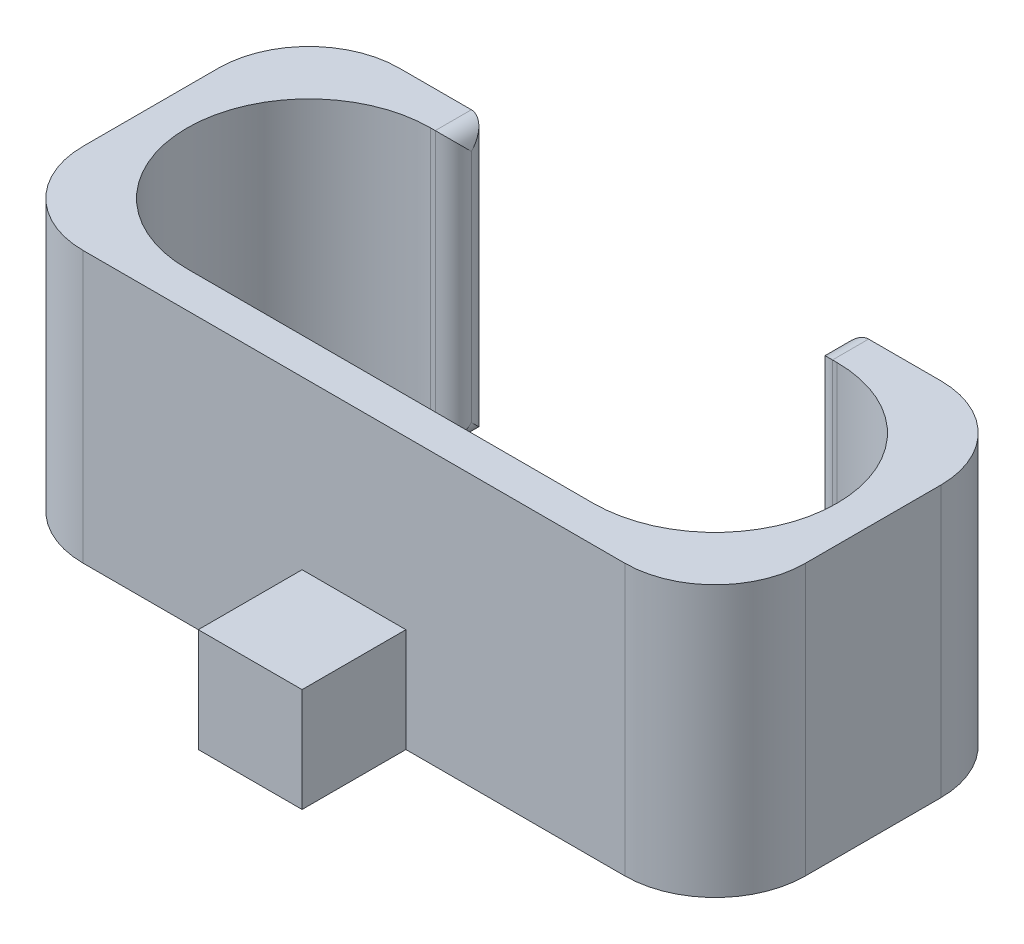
ISO-10303-21;
HEADER;
FILE_DESCRIPTION(('STEP AP214'),'2;1');
FILE_NAME('part.step','',(''),(''),'','','');
FILE_SCHEMA(('AUTOMOTIVE_DESIGN { 1 0 10303 214 1 1 1 1 }'));
ENDSEC;
DATA;
#1=APPLICATION_CONTEXT('core data for automotive mechanical design processes');
#2=APPLICATION_PROTOCOL_DEFINITION('international standard','automotive_design',2000,#1);
#3=PRODUCT_CONTEXT('',#1,'mechanical');
#4=PRODUCT('Part','Part','',(#3));
#5=PRODUCT_RELATED_PRODUCT_CATEGORY('part','',(#4));
#6=PRODUCT_DEFINITION_FORMATION('','',#4);
#7=PRODUCT_DEFINITION_CONTEXT('part definition',#1,'design');
#8=PRODUCT_DEFINITION('design','',#6,#7);
#9=PRODUCT_DEFINITION_SHAPE('','',#8);
#10=(LENGTH_UNIT() NAMED_UNIT(*) SI_UNIT(.MILLI.,.METRE.));
#11=(NAMED_UNIT(*) PLANE_ANGLE_UNIT() SI_UNIT($,.RADIAN.));
#12=(NAMED_UNIT(*) SI_UNIT($,.STERADIAN.) SOLID_ANGLE_UNIT());
#13=UNCERTAINTY_MEASURE_WITH_UNIT(LENGTH_MEASURE(1.E-05),#10,'distance_accuracy_value','');
#14=(GEOMETRIC_REPRESENTATION_CONTEXT(3) GLOBAL_UNCERTAINTY_ASSIGNED_CONTEXT((#13)) GLOBAL_UNIT_ASSIGNED_CONTEXT((#10,
#11,#12)) REPRESENTATION_CONTEXT('',''));
#15=CARTESIAN_POINT('',(0.,0.,0.));
#16=DIRECTION('',(0.,0.,1.));
#17=DIRECTION('',(1.,0.,0.));
#18=AXIS2_PLACEMENT_3D('',#15,#16,#17);
#19=CARTESIAN_POINT('',(-40.,30.,-35.));
#20=DIRECTION('',(0.,0.,1.));
#21=DIRECTION('',(1.,0.,0.));
#22=AXIS2_PLACEMENT_3D('',#19,#20,#21);
#23=PLANE('',#22);
#24=DIRECTION('',(-1.,0.,0.));
#25=VECTOR('',#24,1.);
#26=CARTESIAN_POINT('',(-40.,0.,-35.));
#27=LINE('',#26,#25);
#28=CARTESIAN_POINT('',(30.,0.,-35.));
#29=VERTEX_POINT('',#28);
#30=CARTESIAN_POINT('',(22.,0.,-35.));
#31=VERTEX_POINT('',#30);
#32=EDGE_CURVE('E202',#29,#31,#27,.T.);
#33=ORIENTED_EDGE('',*,*,#32,.T.);
#34=DIRECTION('',(0.,1.,0.));
#35=VECTOR('',#34,1.);
#36=CARTESIAN_POINT('',(22.,30.,-35.));
#37=LINE('',#36,#35);
#38=CARTESIAN_POINT('',(22.,30.,-35.));
#39=VERTEX_POINT('',#38);
#40=EDGE_CURVE('E12',#31,#39,#37,.T.);
#41=ORIENTED_EDGE('',*,*,#40,.T.);
#42=DIRECTION('',(-1.,0.,0.));
#43=VECTOR('',#42,1.);
#44=CARTESIAN_POINT('',(-40.,30.,-35.));
#45=LINE('',#44,#43);
#46=CARTESIAN_POINT('',(30.,30.,-35.));
#47=VERTEX_POINT('',#46);
#48=EDGE_CURVE('E265',#47,#39,#45,.T.);
#49=ORIENTED_EDGE('',*,*,#48,.F.);
#50=DIRECTION('',(0.,-1.,0.));
#51=VECTOR('',#50,1.);
#52=CARTESIAN_POINT('',(30.,30.,-35.));
#53=LINE('',#52,#51);
#54=EDGE_CURVE('E135',#47,#29,#53,.T.);
#55=ORIENTED_EDGE('',*,*,#54,.T.);
#56=EDGE_LOOP('',(#33,#41,#49,#55));
#57=FACE_BOUND('',#56,.T.);
#58=ADVANCED_FACE('F42',(#57),#23,.F.);
#59=CARTESIAN_POINT('',(-22.5,0.,-31.));
#60=DIRECTION('',(0.,0.,-1.));
#61=DIRECTION('',(-1.,0.,0.));
#62=AXIS2_PLACEMENT_3D('',#59,#60,#61);
#63=PLANE('',#62);
#64=DIRECTION('',(-1.,0.,0.));
#65=VECTOR('',#64,1.);
#66=CARTESIAN_POINT('',(-22.5,30.,-31.));
#67=LINE('',#66,#65);
#68=CARTESIAN_POINT('',(22.5,30.,-31.));
#69=VERTEX_POINT('',#68);
#70=CARTESIAN_POINT('',(22.,30.,-31.));
#71=VERTEX_POINT('',#70);
#72=EDGE_CURVE('E245',#69,#71,#67,.T.);
#73=ORIENTED_EDGE('',*,*,#72,.T.);
#74=DIRECTION('',(0.,1.,0.));
#75=VECTOR('',#74,1.);
#76=CARTESIAN_POINT('',(22.,0.,-31.));
#77=LINE('',#76,#75);
#78=CARTESIAN_POINT('',(22.,0.,-31.));
#79=VERTEX_POINT('',#78);
#80=EDGE_CURVE('E52',#71,#79,#77,.F.);
#81=ORIENTED_EDGE('',*,*,#80,.T.);
#82=DIRECTION('',(-1.,0.,0.));
#83=VECTOR('',#82,1.);
#84=CARTESIAN_POINT('',(-22.5,0.,-31.));
#85=LINE('',#84,#83);
#86=CARTESIAN_POINT('',(22.5,0.,-31.));
#87=VERTEX_POINT('',#86);
#88=EDGE_CURVE('E240',#87,#79,#85,.T.);
#89=ORIENTED_EDGE('',*,*,#88,.F.);
#90=DIRECTION('',(0.,1.,0.));
#91=VECTOR('',#90,1.);
#92=CARTESIAN_POINT('',(22.5,0.,-31.));
#93=LINE('',#92,#91);
#94=EDGE_CURVE('E252',#87,#69,#93,.T.);
#95=ORIENTED_EDGE('',*,*,#94,.T.);
#96=EDGE_LOOP('',(#73,#81,#89,#95));
#97=FACE_BOUND('',#96,.T.);
#98=ADVANCED_FACE('F404',(#97),#63,.F.);
#99=CARTESIAN_POINT('',(-40.,30.,0.));
#100=DIRECTION('',(0.,0.,-1.));
#101=DIRECTION('',(-1.,0.,0.));
#102=AXIS2_PLACEMENT_3D('',#99,#100,#101);
#103=PLANE('',#102);
#104=DIRECTION('',(1.,0.,0.));
#105=VECTOR('',#104,1.);
#106=CARTESIAN_POINT('',(-40.,30.,0.));
#107=LINE('',#106,#105);
#108=CARTESIAN_POINT('',(-30.,30.,0.));
#109=VERTEX_POINT('',#108);
#110=CARTESIAN_POINT('',(30.,30.,0.));
#111=VERTEX_POINT('',#110);
#112=EDGE_CURVE('E259',#109,#111,#107,.T.);
#113=ORIENTED_EDGE('',*,*,#112,.F.);
#114=DIRECTION('',(0.,-1.,0.));
#115=VECTOR('',#114,1.);
#116=CARTESIAN_POINT('',(-30.,30.,0.));
#117=LINE('',#116,#115);
#118=CARTESIAN_POINT('',(-30.,0.,0.));
#119=VERTEX_POINT('',#118);
#120=EDGE_CURVE('E177',#109,#119,#117,.T.);
#121=ORIENTED_EDGE('',*,*,#120,.T.);
#122=DIRECTION('',(1.,0.,0.));
#123=VECTOR('',#122,1.);
#124=CARTESIAN_POINT('',(-40.,0.,0.));
#125=LINE('',#124,#123);
#126=CARTESIAN_POINT('',(-5.75,0.,0.));
#127=VERTEX_POINT('',#126);
#128=EDGE_CURVE('E184',#119,#127,#125,.T.);
#129=ORIENTED_EDGE('',*,*,#128,.T.);
#130=DIRECTION('',(0.,-1.,0.));
#131=VECTOR('',#130,1.);
#132=CARTESIAN_POINT('',(-5.75,11.5,0.));
#133=LINE('',#132,#131);
#134=CARTESIAN_POINT('',(-5.75,11.5,0.));
#135=VERTEX_POINT('',#134);
#136=EDGE_CURVE('E207',#135,#127,#133,.T.);
#137=ORIENTED_EDGE('',*,*,#136,.F.);
#138=DIRECTION('',(-1.,0.,0.));
#139=VECTOR('',#138,1.);
#140=CARTESIAN_POINT('',(5.75,11.5,0.));
#141=LINE('',#140,#139);
#142=CARTESIAN_POINT('',(5.75,11.5,0.));
#143=VERTEX_POINT('',#142);
#144=EDGE_CURVE('E206',#143,#135,#141,.T.);
#145=ORIENTED_EDGE('',*,*,#144,.F.);
#146=DIRECTION('',(0.,1.,0.));
#147=VECTOR('',#146,1.);
#148=CARTESIAN_POINT('',(5.75,0.,0.));
#149=LINE('',#148,#147);
#150=CARTESIAN_POINT('',(5.75,0.,0.));
#151=VERTEX_POINT('',#150);
#152=EDGE_CURVE('E203',#151,#143,#149,.T.);
#153=ORIENTED_EDGE('',*,*,#152,.F.);
#154=CARTESIAN_POINT('',(30.,0.,0.));
#155=VERTEX_POINT('',#154);
#156=EDGE_CURVE('E189',#151,#155,#125,.T.);
#157=ORIENTED_EDGE('',*,*,#156,.T.);
#158=DIRECTION('',(0.,-1.,0.));
#159=VECTOR('',#158,1.);
#160=CARTESIAN_POINT('',(30.,30.,0.));
#161=LINE('',#160,#159);
#162=EDGE_CURVE('E180',#155,#111,#161,.F.);
#163=ORIENTED_EDGE('',*,*,#162,.T.);
#164=EDGE_LOOP('',(#113,#121,#129,#137,#145,#153,#157,#163));
#165=FACE_BOUND('',#164,.T.);
#166=ADVANCED_FACE('F323',(#165),#103,.F.);
#167=CARTESIAN_POINT('',(-40.,30.,0.));
#168=DIRECTION('',(1.,0.,0.));
#169=DIRECTION('',(0.,0.,-1.));
#170=AXIS2_PLACEMENT_3D('',#167,#168,#169);
#171=PLANE('',#170);
#172=DIRECTION('',(0.,0.,1.));
#173=VECTOR('',#172,1.);
#174=CARTESIAN_POINT('',(-40.,0.,0.));
#175=LINE('',#174,#173);
#176=CARTESIAN_POINT('',(-40.,0.,-25.));
#177=VERTEX_POINT('',#176);
#178=CARTESIAN_POINT('',(-40.,0.,-10.));
#179=VERTEX_POINT('',#178);
#180=EDGE_CURVE('E195',#177,#179,#175,.T.);
#181=ORIENTED_EDGE('',*,*,#180,.T.);
#182=DIRECTION('',(0.,-1.,0.));
#183=VECTOR('',#182,1.);
#184=CARTESIAN_POINT('',(-40.,30.,-10.));
#185=LINE('',#184,#183);
#186=CARTESIAN_POINT('',(-40.,30.,-10.));
#187=VERTEX_POINT('',#186);
#188=EDGE_CURVE('E159',#179,#187,#185,.F.);
#189=ORIENTED_EDGE('',*,*,#188,.T.);
#190=DIRECTION('',(0.,0.,1.));
#191=VECTOR('',#190,1.);
#192=CARTESIAN_POINT('',(-40.,30.,0.));
#193=LINE('',#192,#191);
#194=CARTESIAN_POINT('',(-40.,30.,-25.));
#195=VERTEX_POINT('',#194);
#196=EDGE_CURVE('E256',#195,#187,#193,.T.);
#197=ORIENTED_EDGE('',*,*,#196,.F.);
#198=DIRECTION('',(0.,-1.,0.));
#199=VECTOR('',#198,1.);
#200=CARTESIAN_POINT('',(-40.,30.,-25.));
#201=LINE('',#200,#199);
#202=EDGE_CURVE('E162',#195,#177,#201,.T.);
#203=ORIENTED_EDGE('',*,*,#202,.T.);
#204=EDGE_LOOP('',(#181,#189,#197,#203));
#205=FACE_BOUND('',#204,.T.);
#206=ADVANCED_FACE('F302',(#205),#171,.F.);
#207=CARTESIAN_POINT('',(40.,30.,0.));
#208=DIRECTION('',(-1.,0.,0.));
#209=DIRECTION('',(0.,0.,1.));
#210=AXIS2_PLACEMENT_3D('',#207,#208,#209);
#211=PLANE('',#210);
#212=DIRECTION('',(0.,0.,-1.));
#213=VECTOR('',#212,1.);
#214=CARTESIAN_POINT('',(40.,30.,0.));
#215=LINE('',#214,#213);
#216=CARTESIAN_POINT('',(40.,30.,-10.));
#217=VERTEX_POINT('',#216);
#218=CARTESIAN_POINT('',(40.,30.,-25.));
#219=VERTEX_POINT('',#218);
#220=EDGE_CURVE('E262',#217,#219,#215,.T.);
#221=ORIENTED_EDGE('',*,*,#220,.F.);
#222=DIRECTION('',(0.,-1.,0.));
#223=VECTOR('',#222,1.);
#224=CARTESIAN_POINT('',(40.,30.,-10.));
#225=LINE('',#224,#223);
#226=CARTESIAN_POINT('',(40.,0.,-10.));
#227=VERTEX_POINT('',#226);
#228=EDGE_CURVE('E138',#217,#227,#225,.T.);
#229=ORIENTED_EDGE('',*,*,#228,.T.);
#230=DIRECTION('',(0.,0.,-1.));
#231=VECTOR('',#230,1.);
#232=CARTESIAN_POINT('',(40.,0.,0.));
#233=LINE('',#232,#231);
#234=CARTESIAN_POINT('',(40.,0.,-25.));
#235=VERTEX_POINT('',#234);
#236=EDGE_CURVE('E188',#227,#235,#233,.T.);
#237=ORIENTED_EDGE('',*,*,#236,.T.);
#238=DIRECTION('',(0.,-1.,0.));
#239=VECTOR('',#238,1.);
#240=CARTESIAN_POINT('',(40.,30.,-25.));
#241=LINE('',#240,#239);
#242=EDGE_CURVE('E141',#235,#219,#241,.F.);
#243=ORIENTED_EDGE('',*,*,#242,.T.);
#244=EDGE_LOOP('',(#221,#229,#237,#243));
#245=FACE_BOUND('',#244,.T.);
#246=ADVANCED_FACE('F342',(#245),#211,.F.);
#247=CARTESIAN_POINT('',(-22.,30.,-35.));
#248=VERTEX_POINT('',#247);
#249=CARTESIAN_POINT('',(-30.,30.,-35.));
#250=VERTEX_POINT('',#249);
#251=EDGE_CURVE('E264',#248,#250,#45,.T.);
#252=ORIENTED_EDGE('',*,*,#251,.F.);
#253=DIRECTION('',(0.,1.,0.));
#254=VECTOR('',#253,1.);
#255=CARTESIAN_POINT('',(-22.,30.,-35.));
#256=LINE('',#255,#254);
#257=CARTESIAN_POINT('',(-22.,0.,-35.));
#258=VERTEX_POINT('',#257);
#259=EDGE_CURVE('E132',#248,#258,#256,.F.);
#260=ORIENTED_EDGE('',*,*,#259,.T.);
#261=CARTESIAN_POINT('',(-30.,0.,-35.));
#262=VERTEX_POINT('',#261);
#263=EDGE_CURVE('E291',#258,#262,#27,.T.);
#264=ORIENTED_EDGE('',*,*,#263,.T.);
#265=DIRECTION('',(0.,-1.,0.));
#266=VECTOR('',#265,1.);
#267=CARTESIAN_POINT('',(-30.,30.,-35.));
#268=LINE('',#267,#266);
#269=EDGE_CURVE('E144',#262,#250,#268,.F.);
#270=ORIENTED_EDGE('',*,*,#269,.T.);
#271=EDGE_LOOP('',(#252,#260,#264,#270));
#272=FACE_BOUND('',#271,.T.);
#273=ADVANCED_FACE('F288',(#272),#23,.F.);
#274=CARTESIAN_POINT('',(0.,30.,0.));
#275=DIRECTION('',(0.,-1.,0.));
#276=DIRECTION('',(0.,0.,-1.));
#277=AXIS2_PLACEMENT_3D('',#274,#275,#276);
#278=PLANE('',#277);
#279=CARTESIAN_POINT('',(-22.,30.,-31.));
#280=VERTEX_POINT('',#279);
#281=CARTESIAN_POINT('',(-22.5,30.,-31.));
#282=VERTEX_POINT('',#281);
#283=EDGE_CURVE('E248',#280,#282,#67,.T.);
#284=ORIENTED_EDGE('',*,*,#283,.F.);
#285=DIRECTION('',(0.,0.,1.));
#286=VECTOR('',#285,1.);
#287=CARTESIAN_POINT('',(-22.,30.,0.));
#288=LINE('',#287,#286);
#289=EDGE_CURVE('E121',#280,#248,#288,.F.);
#290=ORIENTED_EDGE('',*,*,#289,.T.);
#291=ORIENTED_EDGE('',*,*,#251,.T.);
#292=CARTESIAN_POINT('',(-30.,30.,-25.));
#293=DIRECTION('',(0.,-1.,0.));
#294=DIRECTION('',(0.,0.,-1.));
#295=AXIS2_PLACEMENT_3D('',#292,#293,#294);
#296=CIRCLE('',#295,10.);
#297=EDGE_CURVE('E150',#250,#195,#296,.F.);
#298=ORIENTED_EDGE('',*,*,#297,.T.);
#299=ORIENTED_EDGE('',*,*,#196,.T.);
#300=CARTESIAN_POINT('',(-30.,30.,-10.));
#301=DIRECTION('',(0.,-1.,0.));
#302=DIRECTION('',(0.,0.,-1.));
#303=AXIS2_PLACEMENT_3D('',#300,#301,#302);
#304=CIRCLE('',#303,10.);
#305=EDGE_CURVE('E147',#187,#109,#304,.F.);
#306=ORIENTED_EDGE('',*,*,#305,.T.);
#307=ORIENTED_EDGE('',*,*,#112,.T.);
#308=CARTESIAN_POINT('',(30.,30.,-10.));
#309=DIRECTION('',(0.,-1.,0.));
#310=DIRECTION('',(0.,0.,-1.));
#311=AXIS2_PLACEMENT_3D('',#308,#309,#310);
#312=CIRCLE('',#311,10.);
#313=EDGE_CURVE('E153',#111,#217,#312,.F.);
#314=ORIENTED_EDGE('',*,*,#313,.T.);
#315=ORIENTED_EDGE('',*,*,#220,.T.);
#316=CARTESIAN_POINT('',(30.,30.,-25.));
#317=DIRECTION('',(0.,-1.,0.));
#318=DIRECTION('',(0.,0.,-1.));
#319=AXIS2_PLACEMENT_3D('',#316,#317,#318);
#320=CIRCLE('',#319,10.);
#321=EDGE_CURVE('E156',#219,#47,#320,.F.);
#322=ORIENTED_EDGE('',*,*,#321,.T.);
#323=ORIENTED_EDGE('',*,*,#48,.T.);
#324=DIRECTION('',(0.,0.,-1.));
#325=VECTOR('',#324,1.);
#326=CARTESIAN_POINT('',(22.,30.,0.));
#327=LINE('',#326,#325);
#328=EDGE_CURVE('E61',#39,#71,#327,.F.);
#329=ORIENTED_EDGE('',*,*,#328,.T.);
#330=ORIENTED_EDGE('',*,*,#72,.F.);
#331=CARTESIAN_POINT('',(22.5,30.,-17.5));
#332=DIRECTION('',(0.,1.,0.));
#333=DIRECTION('',(0.,0.,1.));
#334=AXIS2_PLACEMENT_3D('',#331,#332,#333);
#335=CIRCLE('',#334,13.5);
#336=CARTESIAN_POINT('',(22.5,30.,-4.00000000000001));
#337=VERTEX_POINT('',#336);
#338=EDGE_CURVE('E751',#337,#69,#335,.T.);
#339=ORIENTED_EDGE('',*,*,#338,.F.);
#340=DIRECTION('',(1.,0.,0.));
#341=VECTOR('',#340,1.);
#342=CARTESIAN_POINT('',(0.,30.,-4.));
#343=LINE('',#342,#341);
#344=CARTESIAN_POINT('',(-22.5,30.,-4.));
#345=VERTEX_POINT('',#344);
#346=EDGE_CURVE('E219',#345,#337,#343,.T.);
#347=ORIENTED_EDGE('',*,*,#346,.F.);
#348=CARTESIAN_POINT('',(-22.5,30.,-17.5));
#349=DIRECTION('',(0.,1.,0.));
#350=DIRECTION('',(0.,0.,1.));
#351=AXIS2_PLACEMENT_3D('',#348,#349,#350);
#352=CIRCLE('',#351,13.5);
#353=EDGE_CURVE('E225',#282,#345,#352,.T.);
#354=ORIENTED_EDGE('',*,*,#353,.F.);
#355=EDGE_LOOP('',(#284,#290,#291,#298,#299,#306,#307,#314,#315,#322,#323,#329,#330,#339,#347,#354));
#356=FACE_BOUND('',#355,.T.);
#357=ADVANCED_FACE('F275',(#356),#278,.F.);
#358=CARTESIAN_POINT('',(0.,0.,0.));
#359=DIRECTION('',(0.,-1.,0.));
#360=DIRECTION('',(0.,0.,-1.));
#361=AXIS2_PLACEMENT_3D('',#358,#359,#360);
#362=PLANE('',#361);
#363=ORIENTED_EDGE('',*,*,#263,.F.);
#364=DIRECTION('',(0.,0.,1.));
#365=VECTOR('',#364,1.);
#366=CARTESIAN_POINT('',(-22.,0.,-31.));
#367=LINE('',#366,#365);
#368=CARTESIAN_POINT('',(-22.,0.,-31.));
#369=VERTEX_POINT('',#368);
#370=EDGE_CURVE('E128',#258,#369,#367,.T.);
#371=ORIENTED_EDGE('',*,*,#370,.T.);
#372=CARTESIAN_POINT('',(-22.5,0.,-31.));
#373=VERTEX_POINT('',#372);
#374=EDGE_CURVE('E244',#369,#373,#85,.T.);
#375=ORIENTED_EDGE('',*,*,#374,.T.);
#376=CARTESIAN_POINT('',(-22.5,0.,-17.5));
#377=DIRECTION('',(0.,1.,0.));
#378=DIRECTION('',(0.,0.,1.));
#379=AXIS2_PLACEMENT_3D('',#376,#377,#378);
#380=CIRCLE('',#379,13.5);
#381=CARTESIAN_POINT('',(-22.5,0.,-4.));
#382=VERTEX_POINT('',#381);
#383=EDGE_CURVE('E755',#373,#382,#380,.T.);
#384=ORIENTED_EDGE('',*,*,#383,.T.);
#385=DIRECTION('',(1.,0.,0.));
#386=VECTOR('',#385,1.);
#387=CARTESIAN_POINT('',(0.,0.,-4.));
#388=LINE('',#387,#386);
#389=CARTESIAN_POINT('',(22.5,0.,-4.00000000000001));
#390=VERTEX_POINT('',#389);
#391=EDGE_CURVE('E247',#382,#390,#388,.T.);
#392=ORIENTED_EDGE('',*,*,#391,.T.);
#393=CARTESIAN_POINT('',(22.5,0.,-17.5));
#394=DIRECTION('',(0.,1.,0.));
#395=DIRECTION('',(0.,0.,1.));
#396=AXIS2_PLACEMENT_3D('',#393,#394,#395);
#397=CIRCLE('',#396,13.5);
#398=EDGE_CURVE('E749',#390,#87,#397,.T.);
#399=ORIENTED_EDGE('',*,*,#398,.T.);
#400=ORIENTED_EDGE('',*,*,#88,.T.);
#401=DIRECTION('',(0.,0.,-1.));
#402=VECTOR('',#401,1.);
#403=CARTESIAN_POINT('',(22.,0.,-35.));
#404=LINE('',#403,#402);
#405=EDGE_CURVE('E97',#79,#31,#404,.T.);
#406=ORIENTED_EDGE('',*,*,#405,.T.);
#407=ORIENTED_EDGE('',*,*,#32,.F.);
#408=CARTESIAN_POINT('',(30.,0.,-25.));
#409=DIRECTION('',(0.,-1.,0.));
#410=DIRECTION('',(0.,0.,-1.));
#411=AXIS2_PLACEMENT_3D('',#408,#409,#410);
#412=CIRCLE('',#411,10.);
#413=EDGE_CURVE('E174',#29,#235,#412,.T.);
#414=ORIENTED_EDGE('',*,*,#413,.T.);
#415=ORIENTED_EDGE('',*,*,#236,.F.);
#416=CARTESIAN_POINT('',(30.,0.,-10.));
#417=DIRECTION('',(0.,-1.,0.));
#418=DIRECTION('',(0.,0.,-1.));
#419=AXIS2_PLACEMENT_3D('',#416,#417,#418);
#420=CIRCLE('',#419,10.);
#421=EDGE_CURVE('E171',#227,#155,#420,.T.);
#422=ORIENTED_EDGE('',*,*,#421,.T.);
#423=ORIENTED_EDGE('',*,*,#156,.F.);
#424=DIRECTION('',(0.,0.,-1.));
#425=VECTOR('',#424,1.);
#426=CARTESIAN_POINT('',(5.75,0.,11.5));
#427=LINE('',#426,#425);
#428=CARTESIAN_POINT('',(5.75,0.,11.5));
#429=VERTEX_POINT('',#428);
#430=EDGE_CURVE('E210',#429,#151,#427,.T.);
#431=ORIENTED_EDGE('',*,*,#430,.F.);
#432=DIRECTION('',(1.,0.,0.));
#433=VECTOR('',#432,1.);
#434=CARTESIAN_POINT('',(-5.75,0.,11.5));
#435=LINE('',#434,#433);
#436=CARTESIAN_POINT('',(-5.75,0.,11.5));
#437=VERTEX_POINT('',#436);
#438=EDGE_CURVE('E770',#437,#429,#435,.T.);
#439=ORIENTED_EDGE('',*,*,#438,.F.);
#440=DIRECTION('',(0.,0.,-1.));
#441=VECTOR('',#440,1.);
#442=CARTESIAN_POINT('',(-5.75,0.,11.5));
#443=LINE('',#442,#441);
#444=EDGE_CURVE('E213',#437,#127,#443,.T.);
#445=ORIENTED_EDGE('',*,*,#444,.T.);
#446=ORIENTED_EDGE('',*,*,#128,.F.);
#447=CARTESIAN_POINT('',(-30.,0.,-10.));
#448=DIRECTION('',(0.,-1.,0.));
#449=DIRECTION('',(0.,0.,-1.));
#450=AXIS2_PLACEMENT_3D('',#447,#448,#449);
#451=CIRCLE('',#450,10.);
#452=EDGE_CURVE('E165',#119,#179,#451,.T.);
#453=ORIENTED_EDGE('',*,*,#452,.T.);
#454=ORIENTED_EDGE('',*,*,#180,.F.);
#455=CARTESIAN_POINT('',(-30.,0.,-25.));
#456=DIRECTION('',(0.,-1.,0.));
#457=DIRECTION('',(0.,0.,-1.));
#458=AXIS2_PLACEMENT_3D('',#455,#456,#457);
#459=CIRCLE('',#458,10.);
#460=EDGE_CURVE('E168',#177,#262,#459,.T.);
#461=ORIENTED_EDGE('',*,*,#460,.T.);
#462=EDGE_LOOP('',(#363,#371,#375,#384,#392,#399,#400,#406,#407,#414,#415,#422,#423,#431,#439,
#445,#446,#453,#454,#461));
#463=FACE_BOUND('',#462,.T.);
#464=ADVANCED_FACE('F308',(#463),#362,.T.);
#465=ORIENTED_EDGE('',*,*,#374,.F.);
#466=DIRECTION('',(0.,1.,0.));
#467=VECTOR('',#466,1.);
#468=CARTESIAN_POINT('',(-22.,0.,-31.));
#469=LINE('',#468,#467);
#470=EDGE_CURVE('E125',#369,#280,#469,.T.);
#471=ORIENTED_EDGE('',*,*,#470,.T.);
#472=ORIENTED_EDGE('',*,*,#283,.T.);
#473=DIRECTION('',(0.,1.,0.));
#474=VECTOR('',#473,1.);
#475=CARTESIAN_POINT('',(-22.5,0.,-31.));
#476=LINE('',#475,#474);
#477=EDGE_CURVE('E249',#373,#282,#476,.T.);
#478=ORIENTED_EDGE('',*,*,#477,.F.);
#479=EDGE_LOOP('',(#465,#471,#472,#478));
#480=FACE_BOUND('',#479,.T.);
#481=ADVANCED_FACE('F369',(#480),#63,.F.);
#482=CARTESIAN_POINT('',(-5.75,11.5,11.5));
#483=DIRECTION('',(1.,0.,0.));
#484=DIRECTION('',(0.,1.,0.));
#485=AXIS2_PLACEMENT_3D('',#482,#483,#484);
#486=PLANE('',#485);
#487=ORIENTED_EDGE('',*,*,#136,.T.);
#488=ORIENTED_EDGE('',*,*,#444,.F.);
#489=DIRECTION('',(0.,-1.,0.));
#490=VECTOR('',#489,1.);
#491=CARTESIAN_POINT('',(-5.75,11.5,11.5));
#492=LINE('',#491,#490);
#493=CARTESIAN_POINT('',(-5.75,11.5,11.5));
#494=VERTEX_POINT('',#493);
#495=EDGE_CURVE('E234',#494,#437,#492,.T.);
#496=ORIENTED_EDGE('',*,*,#495,.F.);
#497=DIRECTION('',(0.,0.,-1.));
#498=VECTOR('',#497,1.);
#499=CARTESIAN_POINT('',(-5.75,11.5,11.5));
#500=LINE('',#499,#498);
#501=EDGE_CURVE('E235',#494,#135,#500,.T.);
#502=ORIENTED_EDGE('',*,*,#501,.T.);
#503=EDGE_LOOP('',(#487,#488,#496,#502));
#504=FACE_BOUND('',#503,.T.);
#505=ADVANCED_FACE('F606',(#504),#486,.F.);
#506=CARTESIAN_POINT('',(5.75,0.,11.5));
#507=DIRECTION('',(-1.,0.,0.));
#508=DIRECTION('',(0.,0.,1.));
#509=AXIS2_PLACEMENT_3D('',#506,#507,#508);
#510=PLANE('',#509);
#511=ORIENTED_EDGE('',*,*,#152,.T.);
#512=DIRECTION('',(0.,0.,-1.));
#513=VECTOR('',#512,1.);
#514=CARTESIAN_POINT('',(5.75,11.5,11.5));
#515=LINE('',#514,#513);
#516=CARTESIAN_POINT('',(5.75,11.5,11.5));
#517=VERTEX_POINT('',#516);
#518=EDGE_CURVE('E214',#517,#143,#515,.T.);
#519=ORIENTED_EDGE('',*,*,#518,.F.);
#520=DIRECTION('',(0.,1.,0.));
#521=VECTOR('',#520,1.);
#522=CARTESIAN_POINT('',(5.75,0.,11.5));
#523=LINE('',#522,#521);
#524=EDGE_CURVE('E696',#429,#517,#523,.T.);
#525=ORIENTED_EDGE('',*,*,#524,.F.);
#526=ORIENTED_EDGE('',*,*,#430,.T.);
#527=EDGE_LOOP('',(#511,#519,#525,#526));
#528=FACE_BOUND('',#527,.T.);
#529=ADVANCED_FACE('F597',(#528),#510,.F.);
#530=CARTESIAN_POINT('',(5.75,11.5,11.5));
#531=DIRECTION('',(0.,-1.,0.));
#532=DIRECTION('',(1.,0.,0.));
#533=AXIS2_PLACEMENT_3D('',#530,#531,#532);
#534=PLANE('',#533);
#535=ORIENTED_EDGE('',*,*,#144,.T.);
#536=ORIENTED_EDGE('',*,*,#501,.F.);
#537=DIRECTION('',(-1.,0.,0.));
#538=VECTOR('',#537,1.);
#539=CARTESIAN_POINT('',(5.75,11.5,11.5));
#540=LINE('',#539,#538);
#541=EDGE_CURVE('E230',#517,#494,#540,.T.);
#542=ORIENTED_EDGE('',*,*,#541,.F.);
#543=ORIENTED_EDGE('',*,*,#518,.T.);
#544=EDGE_LOOP('',(#535,#536,#542,#543));
#545=FACE_BOUND('',#544,.T.);
#546=ADVANCED_FACE('F588',(#545),#534,.F.);
#547=CARTESIAN_POINT('',(0.,0.,11.5));
#548=DIRECTION('',(0.,0.,1.));
#549=DIRECTION('',(1.,0.,0.));
#550=AXIS2_PLACEMENT_3D('',#547,#548,#549);
#551=PLANE('',#550);
#552=ORIENTED_EDGE('',*,*,#495,.T.);
#553=ORIENTED_EDGE('',*,*,#438,.T.);
#554=ORIENTED_EDGE('',*,*,#524,.T.);
#555=ORIENTED_EDGE('',*,*,#541,.T.);
#556=EDGE_LOOP('',(#552,#553,#554,#555));
#557=FACE_BOUND('',#556,.T.);
#558=ADVANCED_FACE('F579',(#557),#551,.T.);
#559=CARTESIAN_POINT('',(-22.5,30.,-17.5));
#560=DIRECTION('',(0.,1.,0.));
#561=DIRECTION('',(0.,0.,1.));
#562=AXIS2_PLACEMENT_3D('',#559,#560,#561);
#563=CYLINDRICAL_SURFACE('',#562,13.5);
#564=ORIENTED_EDGE('',*,*,#353,.T.);
#565=DIRECTION('',(0.,1.,0.));
#566=VECTOR('',#565,1.);
#567=CARTESIAN_POINT('',(-22.5,0.,-4.00000000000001));
#568=LINE('',#567,#566);
#569=EDGE_CURVE('E243',#382,#345,#568,.T.);
#570=ORIENTED_EDGE('',*,*,#569,.F.);
#571=ORIENTED_EDGE('',*,*,#383,.F.);
#572=ORIENTED_EDGE('',*,*,#477,.T.);
#573=EDGE_LOOP('',(#564,#570,#571,#572));
#574=FACE_BOUND('',#573,.T.);
#575=ADVANCED_FACE('F570',(#574),#563,.F.);
#576=CARTESIAN_POINT('',(22.5,30.,-17.5));
#577=DIRECTION('',(0.,1.,0.));
#578=DIRECTION('',(0.,0.,1.));
#579=AXIS2_PLACEMENT_3D('',#576,#577,#578);
#580=CYLINDRICAL_SURFACE('',#579,13.5);
#581=ORIENTED_EDGE('',*,*,#398,.F.);
#582=DIRECTION('',(0.,1.,0.));
#583=VECTOR('',#582,1.);
#584=CARTESIAN_POINT('',(22.5,30.,-4.00000000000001));
#585=LINE('',#584,#583);
#586=EDGE_CURVE('E255',#390,#337,#585,.T.);
#587=ORIENTED_EDGE('',*,*,#586,.T.);
#588=ORIENTED_EDGE('',*,*,#338,.T.);
#589=ORIENTED_EDGE('',*,*,#94,.F.);
#590=EDGE_LOOP('',(#581,#587,#588,#589));
#591=FACE_BOUND('',#590,.T.);
#592=ADVANCED_FACE('F552',(#591),#580,.F.);
#593=CARTESIAN_POINT('',(0.,0.,-6.00000000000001));
#594=DIRECTION('',(0.,0.,-1.));
#595=DIRECTION('',(-1.,0.,0.));
#596=AXIS2_PLACEMENT_3D('',#593,#594,#595);
#597=PLANE('',#596);
#598=DIRECTION('',(1.,0.,0.));
#599=VECTOR('',#598,1.);
#600=CARTESIAN_POINT('',(-17.5,10.770329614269,-6.));
#601=LINE('',#600,#599);
#602=CARTESIAN_POINT('',(11.729670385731,10.770329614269,-6.00000000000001));
#603=VERTEX_POINT('',#602);
#604=CARTESIAN_POINT('',(-11.729670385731,10.770329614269,-6.));
#605=VERTEX_POINT('',#604);
#606=EDGE_CURVE('E727',#603,#605,#601,.F.);
#607=ORIENTED_EDGE('',*,*,#606,.T.);
#608=DIRECTION('',(0.,-1.,0.));
#609=VECTOR('',#608,1.);
#610=CARTESIAN_POINT('',(-11.729670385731,26.,-6.));
#611=LINE('',#610,#609);
#612=CARTESIAN_POINT('',(-11.729670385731,19.229670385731,-6.));
#613=VERTEX_POINT('',#612);
#614=EDGE_CURVE('E183',#605,#613,#611,.F.);
#615=ORIENTED_EDGE('',*,*,#614,.T.);
#616=DIRECTION('',(1.,0.,0.));
#617=VECTOR('',#616,1.);
#618=CARTESIAN_POINT('',(17.5,19.229670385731,-6.00000000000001));
#619=LINE('',#618,#617);
#620=CARTESIAN_POINT('',(11.729670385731,19.229670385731,-6.00000000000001));
#621=VERTEX_POINT('',#620);
#622=EDGE_CURVE('E266',#613,#621,#619,.T.);
#623=ORIENTED_EDGE('',*,*,#622,.T.);
#624=DIRECTION('',(0.,-1.,0.));
#625=VECTOR('',#624,1.);
#626=CARTESIAN_POINT('',(11.729670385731,4.,-6.00000000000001));
#627=LINE('',#626,#625);
#628=EDGE_CURVE('E269',#621,#603,#627,.T.);
#629=ORIENTED_EDGE('',*,*,#628,.T.);
#630=EDGE_LOOP('',(#607,#615,#623,#629));
#631=FACE_BOUND('',#630,.T.);
#632=ADVANCED_FACE('F441',(#631),#597,.T.);
#633=CARTESIAN_POINT('',(11.729670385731,30.,24.));
#634=DIRECTION('',(0.,1.,0.));
#635=DIRECTION('',(0.,0.,1.));
#636=AXIS2_PLACEMENT_3D('',#633,#634,#635);
#637=CYLINDRICAL_SURFACE('',#636,30.);
#638=CARTESIAN_POINT('',(11.729670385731,19.229670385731,24.));
#639=DIRECTION('',(-0.707106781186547,0.707106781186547,0.));
#640=DIRECTION('',(-0.707106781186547,-0.707106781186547,0.));
#641=AXIS2_PLACEMENT_3D('',#638,#639,#640);
#642=ELLIPSE('',#641,42.4264068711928,30.);
#643=EDGE_CURVE('E739',#337,#621,#642,.T.);
#644=ORIENTED_EDGE('',*,*,#643,.F.);
#645=ORIENTED_EDGE('',*,*,#586,.F.);
#646=CARTESIAN_POINT('',(11.729670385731,10.770329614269,24.));
#647=DIRECTION('',(0.707106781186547,0.707106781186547,0.));
#648=DIRECTION('',(-0.707106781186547,0.707106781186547,0.));
#649=AXIS2_PLACEMENT_3D('',#646,#647,#648);
#650=ELLIPSE('',#649,42.4264068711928,30.);
#651=EDGE_CURVE('E190',#603,#390,#650,.F.);
#652=ORIENTED_EDGE('',*,*,#651,.F.);
#653=ORIENTED_EDGE('',*,*,#628,.F.);
#654=EDGE_LOOP('',(#644,#645,#652,#653));
#655=FACE_BOUND('',#654,.T.);
#656=ADVANCED_FACE('F437',(#655),#637,.T.);
#657=CARTESIAN_POINT('',(0.,10.770329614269,24.));
#658=DIRECTION('',(-1.,0.,0.));
#659=DIRECTION('',(0.,0.,1.));
#660=AXIS2_PLACEMENT_3D('',#657,#658,#659);
#661=CYLINDRICAL_SURFACE('',#660,30.);
#662=ORIENTED_EDGE('',*,*,#651,.T.);
#663=ORIENTED_EDGE('',*,*,#391,.F.);
#664=CARTESIAN_POINT('',(-11.729670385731,10.770329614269,24.));
#665=DIRECTION('',(-0.707106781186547,0.707106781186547,0.));
#666=DIRECTION('',(-0.707106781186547,-0.707106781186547,0.));
#667=AXIS2_PLACEMENT_3D('',#664,#665,#666);
#668=ELLIPSE('',#667,42.4264068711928,30.);
#669=EDGE_CURVE('E735',#605,#382,#668,.T.);
#670=ORIENTED_EDGE('',*,*,#669,.F.);
#671=ORIENTED_EDGE('',*,*,#606,.F.);
#672=EDGE_LOOP('',(#662,#663,#670,#671));
#673=FACE_BOUND('',#672,.T.);
#674=ADVANCED_FACE('F433',(#673),#661,.T.);
#675=CARTESIAN_POINT('',(0.,19.229670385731,24.));
#676=DIRECTION('',(-1.,0.,0.));
#677=DIRECTION('',(0.,0.,1.));
#678=AXIS2_PLACEMENT_3D('',#675,#676,#677);
#679=CYLINDRICAL_SURFACE('',#678,30.);
#680=ORIENTED_EDGE('',*,*,#643,.T.);
#681=ORIENTED_EDGE('',*,*,#622,.F.);
#682=CARTESIAN_POINT('',(-11.729670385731,19.229670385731,24.));
#683=DIRECTION('',(-0.707106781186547,-0.707106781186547,0.));
#684=DIRECTION('',(-0.707106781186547,0.707106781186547,0.));
#685=AXIS2_PLACEMENT_3D('',#682,#683,#684);
#686=ELLIPSE('',#685,42.4264068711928,30.);
#687=EDGE_CURVE('E109',#345,#613,#686,.T.);
#688=ORIENTED_EDGE('',*,*,#687,.F.);
#689=ORIENTED_EDGE('',*,*,#346,.T.);
#690=EDGE_LOOP('',(#680,#681,#688,#689));
#691=FACE_BOUND('',#690,.T.);
#692=ADVANCED_FACE('F429',(#691),#679,.T.);
#693=CARTESIAN_POINT('',(-11.729670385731,30.,24.));
#694=DIRECTION('',(0.,1.,0.));
#695=DIRECTION('',(0.,0.,1.));
#696=AXIS2_PLACEMENT_3D('',#693,#694,#695);
#697=CYLINDRICAL_SURFACE('',#696,30.);
#698=ORIENTED_EDGE('',*,*,#669,.T.);
#699=ORIENTED_EDGE('',*,*,#569,.T.);
#700=ORIENTED_EDGE('',*,*,#687,.T.);
#701=ORIENTED_EDGE('',*,*,#614,.F.);
#702=EDGE_LOOP('',(#698,#699,#700,#701));
#703=FACE_BOUND('',#702,.T.);
#704=ADVANCED_FACE('F426',(#703),#697,.T.);
#705=CARTESIAN_POINT('',(-30.,30.,-10.));
#706=DIRECTION('',(0.,-1.,0.));
#707=DIRECTION('',(0.,0.,-1.));
#708=AXIS2_PLACEMENT_3D('',#705,#706,#707);
#709=CYLINDRICAL_SURFACE('',#708,10.);
#710=ORIENTED_EDGE('',*,*,#305,.F.);
#711=ORIENTED_EDGE('',*,*,#188,.F.);
#712=ORIENTED_EDGE('',*,*,#452,.F.);
#713=ORIENTED_EDGE('',*,*,#120,.F.);
#714=EDGE_LOOP('',(#710,#711,#712,#713));
#715=FACE_BOUND('',#714,.T.);
#716=ADVANCED_FACE('F316',(#715),#709,.T.);
#717=CARTESIAN_POINT('',(-30.,30.,-25.));
#718=DIRECTION('',(0.,-1.,0.));
#719=DIRECTION('',(0.,0.,-1.));
#720=AXIS2_PLACEMENT_3D('',#717,#718,#719);
#721=CYLINDRICAL_SURFACE('',#720,10.);
#722=ORIENTED_EDGE('',*,*,#297,.F.);
#723=ORIENTED_EDGE('',*,*,#269,.F.);
#724=ORIENTED_EDGE('',*,*,#460,.F.);
#725=ORIENTED_EDGE('',*,*,#202,.F.);
#726=EDGE_LOOP('',(#722,#723,#724,#725));
#727=FACE_BOUND('',#726,.T.);
#728=ADVANCED_FACE('F295',(#727),#721,.T.);
#729=CARTESIAN_POINT('',(30.,30.,-10.));
#730=DIRECTION('',(0.,-1.,0.));
#731=DIRECTION('',(0.,0.,-1.));
#732=AXIS2_PLACEMENT_3D('',#729,#730,#731);
#733=CYLINDRICAL_SURFACE('',#732,10.);
#734=ORIENTED_EDGE('',*,*,#313,.F.);
#735=ORIENTED_EDGE('',*,*,#162,.F.);
#736=ORIENTED_EDGE('',*,*,#421,.F.);
#737=ORIENTED_EDGE('',*,*,#228,.F.);
#738=EDGE_LOOP('',(#734,#735,#736,#737));
#739=FACE_BOUND('',#738,.T.);
#740=ADVANCED_FACE('F334',(#739),#733,.T.);
#741=CARTESIAN_POINT('',(30.,30.,-25.));
#742=DIRECTION('',(0.,-1.,0.));
#743=DIRECTION('',(0.,0.,-1.));
#744=AXIS2_PLACEMENT_3D('',#741,#742,#743);
#745=CYLINDRICAL_SURFACE('',#744,10.);
#746=ORIENTED_EDGE('',*,*,#321,.F.);
#747=ORIENTED_EDGE('',*,*,#242,.F.);
#748=ORIENTED_EDGE('',*,*,#413,.F.);
#749=ORIENTED_EDGE('',*,*,#54,.F.);
#750=EDGE_LOOP('',(#746,#747,#748,#749));
#751=FACE_BOUND('',#750,.T.);
#752=ADVANCED_FACE('F394',(#751),#745,.T.);
#753=CARTESIAN_POINT('',(-22.,2.,0.));
#754=DIRECTION('',(0.,0.,-1.));
#755=DIRECTION('',(-1.,0.,0.));
#756=AXIS2_PLACEMENT_3D('',#753,#754,#755);
#757=CYLINDRICAL_SURFACE('',#756,2.);
#758=CARTESIAN_POINT('',(-22.,2.,-33.));
#759=DIRECTION('',(0.,0.707106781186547,0.707106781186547));
#760=DIRECTION('',(0.,0.707106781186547,-0.707106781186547));
#761=AXIS2_PLACEMENT_3D('',#758,#759,#760);
#762=ELLIPSE('',#761,2.82842712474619,2.);
#763=CARTESIAN_POINT('',(-20.,2.,-33.));
#764=VERTEX_POINT('',#763);
#765=EDGE_CURVE('E107',#369,#764,#762,.T.);
#766=ORIENTED_EDGE('',*,*,#765,.F.);
#767=ORIENTED_EDGE('',*,*,#370,.F.);
#768=CARTESIAN_POINT('',(-22.,2.,-33.));
#769=DIRECTION('',(0.,0.707106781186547,-0.707106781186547));
#770=DIRECTION('',(0.,-0.707106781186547,-0.707106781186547));
#771=AXIS2_PLACEMENT_3D('',#768,#769,#770);
#772=ELLIPSE('',#771,2.82842712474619,2.);
#773=EDGE_CURVE('E112',#764,#258,#772,.T.);
#774=ORIENTED_EDGE('',*,*,#773,.F.);
#775=EDGE_LOOP('',(#766,#767,#774));
#776=FACE_BOUND('',#775,.T.);
#777=ADVANCED_FACE('F392',(#776),#757,.T.);
#778=CARTESIAN_POINT('',(-22.,0.,-33.));
#779=DIRECTION('',(0.,1.,0.));
#780=DIRECTION('',(0.,0.,1.));
#781=AXIS2_PLACEMENT_3D('',#778,#779,#780);
#782=CYLINDRICAL_SURFACE('',#781,2.);
#783=CARTESIAN_POINT('',(-22.,28.,-33.));
#784=DIRECTION('',(0.,-0.707106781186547,0.707106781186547));
#785=DIRECTION('',(0.,0.707106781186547,0.707106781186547));
#786=AXIS2_PLACEMENT_3D('',#783,#784,#785);
#787=ELLIPSE('',#786,2.82842712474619,2.);
#788=CARTESIAN_POINT('',(-20.,28.,-33.));
#789=VERTEX_POINT('',#788);
#790=EDGE_CURVE('E110',#280,#789,#787,.F.);
#791=ORIENTED_EDGE('',*,*,#790,.F.);
#792=ORIENTED_EDGE('',*,*,#470,.F.);
#793=ORIENTED_EDGE('',*,*,#765,.T.);
#794=DIRECTION('',(0.,1.,0.));
#795=VECTOR('',#794,1.);
#796=CARTESIAN_POINT('',(-20.,0.,-33.));
#797=LINE('',#796,#795);
#798=EDGE_CURVE('E115',#789,#764,#797,.F.);
#799=ORIENTED_EDGE('',*,*,#798,.F.);
#800=EDGE_LOOP('',(#791,#792,#793,#799));
#801=FACE_BOUND('',#800,.T.);
#802=ADVANCED_FACE('F380',(#801),#782,.T.);
#803=CARTESIAN_POINT('',(-22.,28.,-35.));
#804=DIRECTION('',(0.,0.,1.));
#805=DIRECTION('',(1.,0.,0.));
#806=AXIS2_PLACEMENT_3D('',#803,#804,#805);
#807=CYLINDRICAL_SURFACE('',#806,2.);
#808=ORIENTED_EDGE('',*,*,#289,.F.);
#809=ORIENTED_EDGE('',*,*,#790,.T.);
#810=CARTESIAN_POINT('',(-22.,28.,-33.));
#811=DIRECTION('',(0.,0.707106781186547,0.707106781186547));
#812=DIRECTION('',(0.,-0.707106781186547,0.707106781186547));
#813=AXIS2_PLACEMENT_3D('',#810,#811,#812);
#814=ELLIPSE('',#813,2.82842712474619,2.);
#815=EDGE_CURVE('E92',#248,#789,#814,.F.);
#816=ORIENTED_EDGE('',*,*,#815,.F.);
#817=EDGE_LOOP('',(#808,#809,#816));
#818=FACE_BOUND('',#817,.T.);
#819=ADVANCED_FACE('F383',(#818),#807,.T.);
#820=CARTESIAN_POINT('',(-22.,0.,-33.));
#821=DIRECTION('',(0.,1.,0.));
#822=DIRECTION('',(0.,0.,1.));
#823=AXIS2_PLACEMENT_3D('',#820,#821,#822);
#824=CYLINDRICAL_SURFACE('',#823,2.);
#825=ORIENTED_EDGE('',*,*,#773,.T.);
#826=ORIENTED_EDGE('',*,*,#259,.F.);
#827=ORIENTED_EDGE('',*,*,#815,.T.);
#828=ORIENTED_EDGE('',*,*,#798,.T.);
#829=EDGE_LOOP('',(#825,#826,#827,#828));
#830=FACE_BOUND('',#829,.T.);
#831=ADVANCED_FACE('F385',(#830),#824,.T.);
#832=CARTESIAN_POINT('',(22.,2.,0.));
#833=DIRECTION('',(0.,0.,1.));
#834=DIRECTION('',(1.,0.,0.));
#835=AXIS2_PLACEMENT_3D('',#832,#833,#834);
#836=CYLINDRICAL_SURFACE('',#835,2.);
#837=CARTESIAN_POINT('',(22.,2.,-33.));
#838=DIRECTION('',(0.,0.707106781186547,-0.707106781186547));
#839=DIRECTION('',(0.,0.707106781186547,0.707106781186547));
#840=AXIS2_PLACEMENT_3D('',#837,#838,#839);
#841=ELLIPSE('',#840,2.82842712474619,2.);
#842=CARTESIAN_POINT('',(20.,2.,-33.));
#843=VERTEX_POINT('',#842);
#844=EDGE_CURVE('E46',#31,#843,#841,.T.);
#845=ORIENTED_EDGE('',*,*,#844,.F.);
#846=ORIENTED_EDGE('',*,*,#405,.F.);
#847=CARTESIAN_POINT('',(22.,2.,-33.));
#848=DIRECTION('',(0.,0.707106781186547,0.707106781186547));
#849=DIRECTION('',(0.,-0.707106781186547,0.707106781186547));
#850=AXIS2_PLACEMENT_3D('',#847,#848,#849);
#851=ELLIPSE('',#850,2.82842712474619,2.);
#852=EDGE_CURVE('E94',#843,#79,#851,.T.);
#853=ORIENTED_EDGE('',*,*,#852,.F.);
#854=EDGE_LOOP('',(#845,#846,#853));
#855=FACE_BOUND('',#854,.T.);
#856=ADVANCED_FACE('F44',(#855),#836,.T.);
#857=CARTESIAN_POINT('',(22.,30.,-33.));
#858=DIRECTION('',(0.,1.,0.));
#859=DIRECTION('',(0.,0.,1.));
#860=AXIS2_PLACEMENT_3D('',#857,#858,#859);
#861=CYLINDRICAL_SURFACE('',#860,2.);
#862=CARTESIAN_POINT('',(22.,28.,-33.));
#863=DIRECTION('',(0.,-0.707106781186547,-0.707106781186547));
#864=DIRECTION('',(0.,0.707106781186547,-0.707106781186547));
#865=AXIS2_PLACEMENT_3D('',#862,#863,#864);
#866=ELLIPSE('',#865,2.82842712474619,2.);
#867=CARTESIAN_POINT('',(20.,28.,-33.));
#868=VERTEX_POINT('',#867);
#869=EDGE_CURVE('E78',#39,#868,#866,.F.);
#870=ORIENTED_EDGE('',*,*,#869,.F.);
#871=ORIENTED_EDGE('',*,*,#40,.F.);
#872=ORIENTED_EDGE('',*,*,#844,.T.);
#873=DIRECTION('',(0.,1.,0.));
#874=VECTOR('',#873,1.);
#875=CARTESIAN_POINT('',(20.,0.,-33.));
#876=LINE('',#875,#874);
#877=EDGE_CURVE('E87',#868,#843,#876,.F.);
#878=ORIENTED_EDGE('',*,*,#877,.F.);
#879=EDGE_LOOP('',(#870,#871,#872,#878));
#880=FACE_BOUND('',#879,.T.);
#881=ADVANCED_FACE('F85',(#880),#861,.T.);
#882=CARTESIAN_POINT('',(22.,28.,-31.));
#883=DIRECTION('',(0.,0.,-1.));
#884=DIRECTION('',(-1.,0.,0.));
#885=AXIS2_PLACEMENT_3D('',#882,#883,#884);
#886=CYLINDRICAL_SURFACE('',#885,2.);
#887=ORIENTED_EDGE('',*,*,#328,.F.);
#888=ORIENTED_EDGE('',*,*,#869,.T.);
#889=CARTESIAN_POINT('',(22.,28.,-33.));
#890=DIRECTION('',(0.,0.707106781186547,-0.707106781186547));
#891=DIRECTION('',(0.,-0.707106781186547,-0.707106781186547));
#892=AXIS2_PLACEMENT_3D('',#889,#890,#891);
#893=ELLIPSE('',#892,2.82842712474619,2.);
#894=EDGE_CURVE('E103',#71,#868,#893,.F.);
#895=ORIENTED_EDGE('',*,*,#894,.F.);
#896=EDGE_LOOP('',(#887,#888,#895));
#897=FACE_BOUND('',#896,.T.);
#898=ADVANCED_FACE('F471',(#897),#886,.T.);
#899=CARTESIAN_POINT('',(22.,0.,-33.));
#900=DIRECTION('',(0.,1.,0.));
#901=DIRECTION('',(0.,0.,1.));
#902=AXIS2_PLACEMENT_3D('',#899,#900,#901);
#903=CYLINDRICAL_SURFACE('',#902,2.);
#904=ORIENTED_EDGE('',*,*,#852,.T.);
#905=ORIENTED_EDGE('',*,*,#80,.F.);
#906=ORIENTED_EDGE('',*,*,#894,.T.);
#907=ORIENTED_EDGE('',*,*,#877,.T.);
#908=EDGE_LOOP('',(#904,#905,#906,#907));
#909=FACE_BOUND('',#908,.T.);
#910=ADVANCED_FACE('F102',(#909),#903,.T.);
#911=CLOSED_SHELL('',(#58,#98,#166,#206,#246,#273,#357,#464,#481,#505,#529,#546,#558,#575,#592,
#632,#656,#674,#692,#704,#716,#728,#740,#752,#777,#802,#819,#831,#856,#881,#898,#910));
#912=MANIFOLD_SOLID_BREP('B2',#911);
#913=ADVANCED_BREP_SHAPE_REPRESENTATION('',(#18,#912),#14);
#914=SHAPE_DEFINITION_REPRESENTATION(#9,#913);
ENDSEC;
END-ISO-10303-21;
